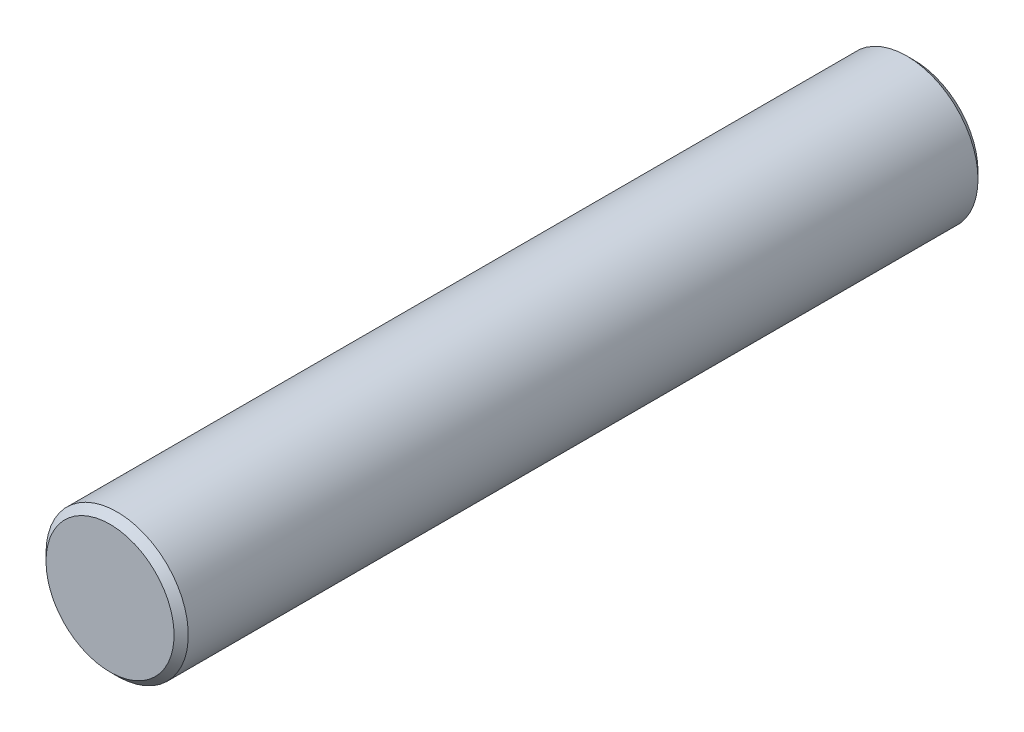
from build123d import *

# Parameters (mm, degrees)
ESQUISSE1_R      = 10
EXTRUSION1_DEPTH = 113
CHANFREIN1_SIZE  = 1


with BuildPart() as part:
    # Esquisse1 → Extrusion1 (new body)
    with BuildSketch(Plane.XY):
        Circle(ESQUISSE1_R)
    extrude(amount=EXTRUSION1_DEPTH)

    # Chanfrein1
    chanfrein1_edges = [part.edges().sort_by_distance(p)[0] for p in [
        (-10, 0, 0),
        (-10, 0, 113),
    ]]
    chamfer(chanfrein1_edges, length=CHANFREIN1_SIZE)


solid = part.part
